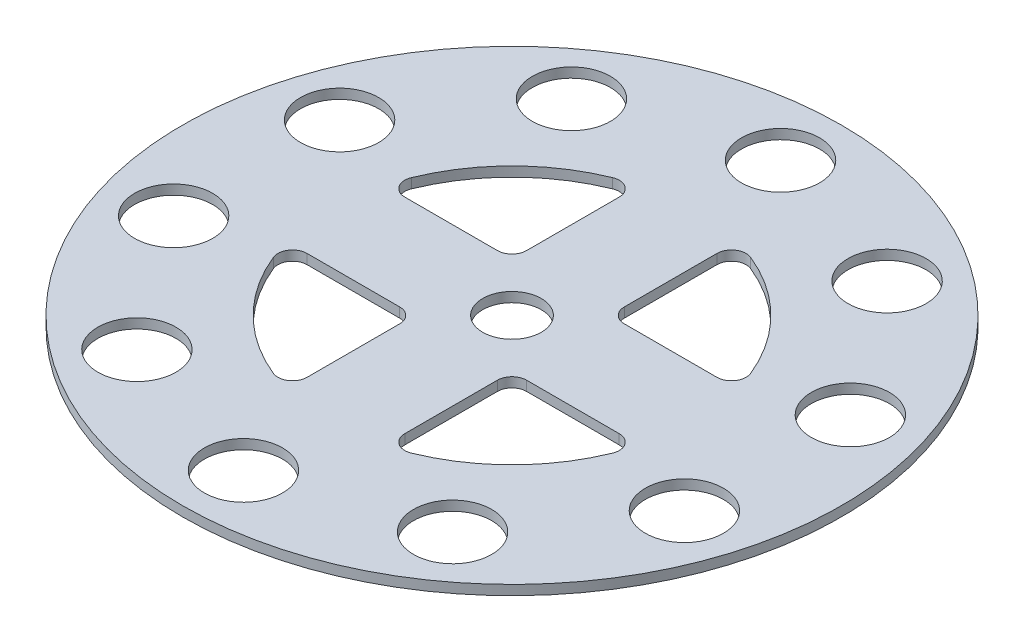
ISO-10303-21;
HEADER;
FILE_DESCRIPTION(('STEP AP214'),'2;1');
FILE_NAME('part.step','',(''),(''),'','','');
FILE_SCHEMA(('AUTOMOTIVE_DESIGN { 1 0 10303 214 1 1 1 1 }'));
ENDSEC;
DATA;
#1=APPLICATION_CONTEXT('core data for automotive mechanical design processes');
#2=APPLICATION_PROTOCOL_DEFINITION('international standard','automotive_design',2000,#1);
#3=PRODUCT_CONTEXT('',#1,'mechanical');
#4=PRODUCT('Part','Part','',(#3));
#5=PRODUCT_RELATED_PRODUCT_CATEGORY('part','',(#4));
#6=PRODUCT_DEFINITION_FORMATION('','',#4);
#7=PRODUCT_DEFINITION_CONTEXT('part definition',#1,'design');
#8=PRODUCT_DEFINITION('design','',#6,#7);
#9=PRODUCT_DEFINITION_SHAPE('','',#8);
#10=(LENGTH_UNIT() NAMED_UNIT(*) SI_UNIT(.MILLI.,.METRE.));
#11=(NAMED_UNIT(*) PLANE_ANGLE_UNIT() SI_UNIT($,.RADIAN.));
#12=(NAMED_UNIT(*) SI_UNIT($,.STERADIAN.) SOLID_ANGLE_UNIT());
#13=UNCERTAINTY_MEASURE_WITH_UNIT(LENGTH_MEASURE(1.E-05),#10,'distance_accuracy_value','');
#14=(GEOMETRIC_REPRESENTATION_CONTEXT(3) GLOBAL_UNCERTAINTY_ASSIGNED_CONTEXT((#13)) GLOBAL_UNIT_ASSIGNED_CONTEXT((#10,
#11,#12)) REPRESENTATION_CONTEXT('',''));
#15=CARTESIAN_POINT('',(0.,0.,0.));
#16=DIRECTION('',(0.,0.,1.));
#17=DIRECTION('',(1.,0.,0.));
#18=AXIS2_PLACEMENT_3D('',#15,#16,#17);
#19=CARTESIAN_POINT('',(0.,2.,0.));
#20=DIRECTION('',(0.,1.,0.));
#21=DIRECTION('',(0.,0.,1.));
#22=AXIS2_PLACEMENT_3D('',#19,#20,#21);
#23=PLANE('',#22);
#24=CARTESIAN_POINT('',(0.,2.,0.));
#25=DIRECTION('',(0.,1.,0.));
#26=DIRECTION('',(0.,0.,1.));
#27=AXIS2_PLACEMENT_3D('',#24,#25,#26);
#28=CIRCLE('',#27,6.);
#29=CARTESIAN_POINT('',(0.,2.,6.));
#30=VERTEX_POINT('',#29);
#31=EDGE_CURVE('E462',#30,#30,#28,.T.);
#32=ORIENTED_EDGE('',*,*,#31,.F.);
#33=EDGE_LOOP('',(#32));
#34=FACE_BOUND('',#33,.T.);
#35=CARTESIAN_POINT('',(-52.3081083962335,2.,-16.995934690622));
#36=DIRECTION('',(0.,1.,0.));
#37=DIRECTION('',(0.951056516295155,0.,0.309016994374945));
#38=AXIS2_PLACEMENT_3D('',#35,#36,#37);
#39=CIRCLE('',#38,8.);
#40=CARTESIAN_POINT('',(-44.6996562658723,2.,-14.5237987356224));
#41=VERTEX_POINT('',#40);
#42=EDGE_CURVE('E457',#41,#41,#39,.T.);
#43=ORIENTED_EDGE('',*,*,#42,.F.);
#44=EDGE_LOOP('',(#43));
#45=FACE_BOUND('',#44,.T.);
#46=CARTESIAN_POINT('',(-52.3081083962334,2.,16.9959346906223));
#47=DIRECTION('',(0.,1.,0.));
#48=DIRECTION('',(0.951056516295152,0.,-0.309016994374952));
#49=AXIS2_PLACEMENT_3D('',#46,#47,#48);
#50=CIRCLE('',#49,8.);
#51=CARTESIAN_POINT('',(-44.6996562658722,2.,14.5237987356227));
#52=VERTEX_POINT('',#51);
#53=EDGE_CURVE('E451',#52,#52,#50,.T.);
#54=ORIENTED_EDGE('',*,*,#53,.F.);
#55=EDGE_LOOP('',(#54));
#56=FACE_BOUND('',#55,.T.);
#57=CARTESIAN_POINT('',(-32.3281888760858,2.,44.4959346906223));
#58=DIRECTION('',(0.,1.,0.));
#59=DIRECTION('',(0.587785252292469,0.,-0.809016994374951));
#60=AXIS2_PLACEMENT_3D('',#57,#58,#59);
#61=CIRCLE('',#60,8.);
#62=CARTESIAN_POINT('',(-27.625906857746,2.,38.0237987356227));
#63=VERTEX_POINT('',#62);
#64=EDGE_CURVE('E445',#63,#63,#61,.T.);
#65=ORIENTED_EDGE('',*,*,#64,.F.);
#66=EDGE_LOOP('',(#65));
#67=FACE_BOUND('',#66,.T.);
#68=CARTESIAN_POINT('',(0.,2.,55.));
#69=DIRECTION('',(0.,1.,0.));
#70=DIRECTION('',(0.,0.,-1.));
#71=AXIS2_PLACEMENT_3D('',#68,#69,#70);
#72=CIRCLE('',#71,8.);
#73=CARTESIAN_POINT('',(0.,2.,47.));
#74=VERTEX_POINT('',#73);
#75=EDGE_CURVE('E439',#74,#74,#72,.T.);
#76=ORIENTED_EDGE('',*,*,#75,.F.);
#77=EDGE_LOOP('',(#76));
#78=FACE_BOUND('',#77,.T.);
#79=CARTESIAN_POINT('',(32.3281888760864,2.,44.4959346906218));
#80=DIRECTION('',(0.,1.,0.));
#81=DIRECTION('',(-0.58778525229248,0.,-0.809016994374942));
#82=AXIS2_PLACEMENT_3D('',#79,#80,#81);
#83=CIRCLE('',#82,8.);
#84=CARTESIAN_POINT('',(27.6259068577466,2.,38.0237987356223));
#85=VERTEX_POINT('',#84);
#86=EDGE_CURVE('E433',#85,#85,#83,.T.);
#87=ORIENTED_EDGE('',*,*,#86,.F.);
#88=EDGE_LOOP('',(#87));
#89=FACE_BOUND('',#88,.T.);
#90=CARTESIAN_POINT('',(52.3081083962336,2.,16.9959346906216));
#91=DIRECTION('',(0.,1.,0.));
#92=DIRECTION('',(-0.951056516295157,0.,-0.309016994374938));
#93=AXIS2_PLACEMENT_3D('',#90,#91,#92);
#94=CIRCLE('',#93,8.);
#95=CARTESIAN_POINT('',(44.6996562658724,2.,14.5237987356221));
#96=VERTEX_POINT('',#95);
#97=EDGE_CURVE('E427',#96,#96,#94,.T.);
#98=ORIENTED_EDGE('',*,*,#97,.F.);
#99=EDGE_LOOP('',(#98));
#100=FACE_BOUND('',#99,.T.);
#101=CARTESIAN_POINT('',(52.3081083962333,2.,-16.9959346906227));
#102=DIRECTION('',(0.,1.,0.));
#103=DIRECTION('',(-0.95105651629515,0.,0.309016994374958));
#104=AXIS2_PLACEMENT_3D('',#101,#102,#103);
#105=CIRCLE('',#104,8.);
#106=CARTESIAN_POINT('',(44.6996562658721,2.,-14.523798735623));
#107=VERTEX_POINT('',#106);
#108=EDGE_CURVE('E421',#107,#107,#105,.T.);
#109=ORIENTED_EDGE('',*,*,#108,.F.);
#110=EDGE_LOOP('',(#109));
#111=FACE_BOUND('',#110,.T.);
#112=CARTESIAN_POINT('',(32.3281888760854,2.,-44.4959346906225));
#113=DIRECTION('',(0.,1.,0.));
#114=DIRECTION('',(-0.587785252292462,0.,0.809016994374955));
#115=AXIS2_PLACEMENT_3D('',#112,#113,#114);
#116=CIRCLE('',#115,8.);
#117=CARTESIAN_POINT('',(27.6259068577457,2.,-38.0237987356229));
#118=VERTEX_POINT('',#117);
#119=EDGE_CURVE('E414',#118,#118,#116,.T.);
#120=ORIENTED_EDGE('',*,*,#119,.F.);
#121=EDGE_LOOP('',(#120));
#122=FACE_BOUND('',#121,.T.);
#123=CARTESIAN_POINT('',(-32.3281888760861,2.,-44.4959346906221));
#124=DIRECTION('',(0.,1.,0.));
#125=DIRECTION('',(0.587785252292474,0.,0.809016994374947));
#126=AXIS2_PLACEMENT_3D('',#123,#124,#125);
#127=CIRCLE('',#126,8.);
#128=CARTESIAN_POINT('',(-27.6259068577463,2.,-38.0237987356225));
#129=VERTEX_POINT('',#128);
#130=EDGE_CURVE('E408',#129,#129,#127,.T.);
#131=ORIENTED_EDGE('',*,*,#130,.F.);
#132=EDGE_LOOP('',(#131));
#133=FACE_BOUND('',#132,.T.);
#134=CARTESIAN_POINT('',(0.,2.,-55.));
#135=DIRECTION('',(0.,1.,0.));
#136=DIRECTION('',(0.,0.,1.));
#137=AXIS2_PLACEMENT_3D('',#134,#135,#136);
#138=CIRCLE('',#137,8.);
#139=CARTESIAN_POINT('',(0.,2.,-47.));
#140=VERTEX_POINT('',#139);
#141=EDGE_CURVE('E402',#140,#140,#138,.T.);
#142=ORIENTED_EDGE('',*,*,#141,.F.);
#143=EDGE_LOOP('',(#142));
#144=FACE_BOUND('',#143,.T.);
#145=CARTESIAN_POINT('',(0.,2.,0.));
#146=DIRECTION('',(0.,1.,0.));
#147=DIRECTION('',(0.,0.,1.));
#148=AXIS2_PLACEMENT_3D('',#145,#146,#147);
#149=CIRCLE('',#148,67.5);
#150=CARTESIAN_POINT('',(0.,2.,67.5));
#151=VERTEX_POINT('',#150);
#152=EDGE_CURVE('E224',#151,#151,#149,.T.);
#153=ORIENTED_EDGE('',*,*,#152,.T.);
#154=EDGE_LOOP('',(#153));
#155=FACE_BOUND('',#154,.T.);
#156=DIRECTION('',(0.,0.,-1.));
#157=VECTOR('',#156,1.);
#158=CARTESIAN_POINT('',(-10.,2.,-36.1420807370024));
#159=LINE('',#158,#157);
#160=CARTESIAN_POINT('',(-10.,2.,-13.));
#161=VERTEX_POINT('',#160);
#162=CARTESIAN_POINT('',(-10.,2.,-31.9570023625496));
#163=VERTEX_POINT('',#162);
#164=EDGE_CURVE('E346',#161,#163,#159,.T.);
#165=ORIENTED_EDGE('',*,*,#164,.F.);
#166=CARTESIAN_POINT('',(-13.,2.,-13.));
#167=DIRECTION('',(0.,1.,0.));
#168=DIRECTION('',(0.,0.,1.));
#169=AXIS2_PLACEMENT_3D('',#166,#167,#168);
#170=CIRCLE('',#169,3.);
#171=CARTESIAN_POINT('',(-13.,2.,-10.));
#172=VERTEX_POINT('',#171);
#173=EDGE_CURVE('E50',#161,#172,#170,.F.);
#174=ORIENTED_EDGE('',*,*,#173,.T.);
#175=DIRECTION('',(1.,0.,0.));
#176=VECTOR('',#175,1.);
#177=CARTESIAN_POINT('',(-36.1420807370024,2.,-10.));
#178=LINE('',#177,#176);
#179=CARTESIAN_POINT('',(-31.9570023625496,2.,-10.));
#180=VERTEX_POINT('',#179);
#181=EDGE_CURVE('E342',#180,#172,#178,.T.);
#182=ORIENTED_EDGE('',*,*,#181,.F.);
#183=CARTESIAN_POINT('',(-31.9570023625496,2.,-13.));
#184=DIRECTION('',(0.,1.,0.));
#185=DIRECTION('',(0.,0.,1.));
#186=AXIS2_PLACEMENT_3D('',#183,#184,#185);
#187=CIRCLE('',#186,3.);
#188=CARTESIAN_POINT('',(-34.7358721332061,2.,-14.1304347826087));
#189=VERTEX_POINT('',#188);
#190=EDGE_CURVE('E11',#180,#189,#187,.F.);
#191=ORIENTED_EDGE('',*,*,#190,.T.);
#192=CARTESIAN_POINT('',(0.,2.,0.));
#193=DIRECTION('',(0.,1.,0.));
#194=DIRECTION('',(0.,0.,1.));
#195=AXIS2_PLACEMENT_3D('',#192,#193,#194);
#196=CIRCLE('',#195,37.5);
#197=CARTESIAN_POINT('',(-14.1304347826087,2.,-34.7358721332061));
#198=VERTEX_POINT('',#197);
#199=EDGE_CURVE('E340',#198,#189,#196,.T.);
#200=ORIENTED_EDGE('',*,*,#199,.F.);
#201=CARTESIAN_POINT('',(-13.,2.,-31.9570023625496));
#202=DIRECTION('',(0.,1.,0.));
#203=DIRECTION('',(0.,0.,1.));
#204=AXIS2_PLACEMENT_3D('',#201,#202,#203);
#205=CIRCLE('',#204,3.);
#206=EDGE_CURVE('E319',#198,#163,#205,.F.);
#207=ORIENTED_EDGE('',*,*,#206,.T.);
#208=EDGE_LOOP('',(#165,#174,#182,#191,#200,#207));
#209=FACE_BOUND('',#208,.T.);
#210=DIRECTION('',(0.,0.,-1.));
#211=VECTOR('',#210,1.);
#212=CARTESIAN_POINT('',(-10.,2.,10.));
#213=LINE('',#212,#211);
#214=CARTESIAN_POINT('',(-10.,2.,31.9570023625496));
#215=VERTEX_POINT('',#214);
#216=CARTESIAN_POINT('',(-10.,2.,13.));
#217=VERTEX_POINT('',#216);
#218=EDGE_CURVE('E369',#215,#217,#213,.T.);
#219=ORIENTED_EDGE('',*,*,#218,.F.);
#220=CARTESIAN_POINT('',(-13.,2.,31.9570023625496));
#221=DIRECTION('',(0.,1.,0.));
#222=DIRECTION('',(0.,0.,1.));
#223=AXIS2_PLACEMENT_3D('',#220,#221,#222);
#224=CIRCLE('',#223,3.);
#225=CARTESIAN_POINT('',(-14.1304347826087,2.,34.7358721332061));
#226=VERTEX_POINT('',#225);
#227=EDGE_CURVE('E299',#215,#226,#224,.F.);
#228=ORIENTED_EDGE('',*,*,#227,.T.);
#229=CARTESIAN_POINT('',(0.,2.,0.));
#230=DIRECTION('',(0.,1.,0.));
#231=DIRECTION('',(0.,0.,1.));
#232=AXIS2_PLACEMENT_3D('',#229,#230,#231);
#233=CIRCLE('',#232,37.5);
#234=CARTESIAN_POINT('',(-34.7358721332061,2.,14.1304347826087));
#235=VERTEX_POINT('',#234);
#236=EDGE_CURVE('E359',#235,#226,#233,.T.);
#237=ORIENTED_EDGE('',*,*,#236,.F.);
#238=CARTESIAN_POINT('',(-31.9570023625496,2.,13.));
#239=DIRECTION('',(0.,1.,0.));
#240=DIRECTION('',(0.,0.,1.));
#241=AXIS2_PLACEMENT_3D('',#238,#239,#240);
#242=CIRCLE('',#241,3.);
#243=CARTESIAN_POINT('',(-31.9570023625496,2.,10.));
#244=VERTEX_POINT('',#243);
#245=EDGE_CURVE('E303',#235,#244,#242,.F.);
#246=ORIENTED_EDGE('',*,*,#245,.T.);
#247=DIRECTION('',(-1.,0.,0.));
#248=VECTOR('',#247,1.);
#249=CARTESIAN_POINT('',(-10.,2.,10.));
#250=LINE('',#249,#248);
#251=CARTESIAN_POINT('',(-13.,2.,10.));
#252=VERTEX_POINT('',#251);
#253=EDGE_CURVE('E334',#252,#244,#250,.T.);
#254=ORIENTED_EDGE('',*,*,#253,.F.);
#255=CARTESIAN_POINT('',(-13.,2.,13.));
#256=DIRECTION('',(0.,1.,0.));
#257=DIRECTION('',(0.,0.,1.));
#258=AXIS2_PLACEMENT_3D('',#255,#256,#257);
#259=CIRCLE('',#258,3.);
#260=EDGE_CURVE('E295',#252,#217,#259,.F.);
#261=ORIENTED_EDGE('',*,*,#260,.T.);
#262=EDGE_LOOP('',(#219,#228,#237,#246,#254,#261));
#263=FACE_BOUND('',#262,.T.);
#264=CARTESIAN_POINT('',(0.,2.,0.));
#265=DIRECTION('',(0.,1.,0.));
#266=DIRECTION('',(0.,0.,1.));
#267=AXIS2_PLACEMENT_3D('',#264,#265,#266);
#268=CIRCLE('',#267,37.5);
#269=CARTESIAN_POINT('',(14.1304347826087,2.,34.7358721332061));
#270=VERTEX_POINT('',#269);
#271=CARTESIAN_POINT('',(34.7358721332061,2.,14.1304347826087));
#272=VERTEX_POINT('',#271);
#273=EDGE_CURVE('E380',#270,#272,#268,.T.);
#274=ORIENTED_EDGE('',*,*,#273,.F.);
#275=CARTESIAN_POINT('',(13.,2.,31.9570023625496));
#276=DIRECTION('',(0.,1.,0.));
#277=DIRECTION('',(0.,0.,1.));
#278=AXIS2_PLACEMENT_3D('',#275,#276,#277);
#279=CIRCLE('',#278,3.);
#280=CARTESIAN_POINT('',(10.,2.,31.9570023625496));
#281=VERTEX_POINT('',#280);
#282=EDGE_CURVE('E209',#270,#281,#279,.F.);
#283=ORIENTED_EDGE('',*,*,#282,.T.);
#284=DIRECTION('',(0.,0.,1.));
#285=VECTOR('',#284,1.);
#286=CARTESIAN_POINT('',(10.,2.,10.));
#287=LINE('',#286,#285);
#288=CARTESIAN_POINT('',(10.,2.,13.));
#289=VERTEX_POINT('',#288);
#290=EDGE_CURVE('E374',#289,#281,#287,.T.);
#291=ORIENTED_EDGE('',*,*,#290,.F.);
#292=CARTESIAN_POINT('',(13.,2.,13.));
#293=DIRECTION('',(0.,1.,0.));
#294=DIRECTION('',(0.,0.,1.));
#295=AXIS2_PLACEMENT_3D('',#292,#293,#294);
#296=CIRCLE('',#295,3.);
#297=CARTESIAN_POINT('',(13.,2.,10.));
#298=VERTEX_POINT('',#297);
#299=EDGE_CURVE('E291',#289,#298,#296,.F.);
#300=ORIENTED_EDGE('',*,*,#299,.T.);
#301=DIRECTION('',(-1.,0.,0.));
#302=VECTOR('',#301,1.);
#303=CARTESIAN_POINT('',(36.1420807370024,2.,10.));
#304=LINE('',#303,#302);
#305=CARTESIAN_POINT('',(31.9570023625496,2.,10.));
#306=VERTEX_POINT('',#305);
#307=EDGE_CURVE('E366',#306,#298,#304,.T.);
#308=ORIENTED_EDGE('',*,*,#307,.F.);
#309=CARTESIAN_POINT('',(31.9570023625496,2.,13.));
#310=DIRECTION('',(0.,1.,0.));
#311=DIRECTION('',(0.,0.,1.));
#312=AXIS2_PLACEMENT_3D('',#309,#310,#311);
#313=CIRCLE('',#312,3.);
#314=EDGE_CURVE('E210',#306,#272,#313,.F.);
#315=ORIENTED_EDGE('',*,*,#314,.T.);
#316=EDGE_LOOP('',(#274,#283,#291,#300,#308,#315));
#317=FACE_BOUND('',#316,.T.);
#318=DIRECTION('',(0.,0.,1.));
#319=VECTOR('',#318,1.);
#320=CARTESIAN_POINT('',(10.,2.,-36.1420807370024));
#321=LINE('',#320,#319);
#322=CARTESIAN_POINT('',(10.,2.,-31.9570023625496));
#323=VERTEX_POINT('',#322);
#324=CARTESIAN_POINT('',(10.,2.,-13.));
#325=VERTEX_POINT('',#324);
#326=EDGE_CURVE('E397',#323,#325,#321,.T.);
#327=ORIENTED_EDGE('',*,*,#326,.F.);
#328=CARTESIAN_POINT('',(13.,2.,-31.9570023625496));
#329=DIRECTION('',(0.,1.,0.));
#330=DIRECTION('',(0.,0.,1.));
#331=AXIS2_PLACEMENT_3D('',#328,#329,#330);
#332=CIRCLE('',#331,3.);
#333=CARTESIAN_POINT('',(14.1304347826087,2.,-34.7358721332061));
#334=VERTEX_POINT('',#333);
#335=EDGE_CURVE('E311',#323,#334,#332,.F.);
#336=ORIENTED_EDGE('',*,*,#335,.T.);
#337=CARTESIAN_POINT('',(0.,2.,0.));
#338=DIRECTION('',(0.,1.,0.));
#339=DIRECTION('',(0.,0.,1.));
#340=AXIS2_PLACEMENT_3D('',#337,#338,#339);
#341=CIRCLE('',#340,37.5);
#342=CARTESIAN_POINT('',(34.7358721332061,2.,-14.1304347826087));
#343=VERTEX_POINT('',#342);
#344=EDGE_CURVE('E387',#343,#334,#341,.T.);
#345=ORIENTED_EDGE('',*,*,#344,.F.);
#346=CARTESIAN_POINT('',(31.9570023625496,2.,-13.));
#347=DIRECTION('',(0.,1.,0.));
#348=DIRECTION('',(0.,0.,1.));
#349=AXIS2_PLACEMENT_3D('',#346,#347,#348);
#350=CIRCLE('',#349,3.);
#351=CARTESIAN_POINT('',(31.9570023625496,2.,-10.));
#352=VERTEX_POINT('',#351);
#353=EDGE_CURVE('E307',#343,#352,#350,.F.);
#354=ORIENTED_EDGE('',*,*,#353,.T.);
#355=DIRECTION('',(1.,0.,0.));
#356=VECTOR('',#355,1.);
#357=CARTESIAN_POINT('',(10.,2.,-10.));
#358=LINE('',#357,#356);
#359=CARTESIAN_POINT('',(13.,2.,-10.));
#360=VERTEX_POINT('',#359);
#361=EDGE_CURVE('E377',#360,#352,#358,.T.);
#362=ORIENTED_EDGE('',*,*,#361,.F.);
#363=CARTESIAN_POINT('',(13.,2.,-13.));
#364=DIRECTION('',(0.,1.,0.));
#365=DIRECTION('',(0.,0.,1.));
#366=AXIS2_PLACEMENT_3D('',#363,#364,#365);
#367=CIRCLE('',#366,3.);
#368=EDGE_CURVE('E315',#360,#325,#367,.F.);
#369=ORIENTED_EDGE('',*,*,#368,.T.);
#370=EDGE_LOOP('',(#327,#336,#345,#354,#362,#369));
#371=FACE_BOUND('',#370,.T.);
#372=ADVANCED_FACE('F35',(#34,#45,#56,#67,#78,#89,#100,#111,#122,#133,#144,#155,#209,#263,#317,
#371),#23,.T.);
#373=CARTESIAN_POINT('',(0.,0.,0.));
#374=DIRECTION('',(0.,1.,0.));
#375=DIRECTION('',(0.,0.,1.));
#376=AXIS2_PLACEMENT_3D('',#373,#374,#375);
#377=PLANE('',#376);
#378=CARTESIAN_POINT('',(0.,0.,0.));
#379=DIRECTION('',(0.,1.,0.));
#380=DIRECTION('',(0.,0.,1.));
#381=AXIS2_PLACEMENT_3D('',#378,#379,#380);
#382=CIRCLE('',#381,6.);
#383=CARTESIAN_POINT('',(0.,0.,6.));
#384=VERTEX_POINT('',#383);
#385=EDGE_CURVE('E418',#384,#384,#382,.T.);
#386=ORIENTED_EDGE('',*,*,#385,.T.);
#387=EDGE_LOOP('',(#386));
#388=FACE_BOUND('',#387,.T.);
#389=CARTESIAN_POINT('',(-52.3081083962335,0.,-16.995934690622));
#390=DIRECTION('',(0.,1.,0.));
#391=DIRECTION('',(0.951056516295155,0.,0.309016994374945));
#392=AXIS2_PLACEMENT_3D('',#389,#390,#391);
#393=CIRCLE('',#392,8.);
#394=CARTESIAN_POINT('',(-44.6996562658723,0.,-14.5237987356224));
#395=VERTEX_POINT('',#394);
#396=EDGE_CURVE('E411',#395,#395,#393,.T.);
#397=ORIENTED_EDGE('',*,*,#396,.T.);
#398=EDGE_LOOP('',(#397));
#399=FACE_BOUND('',#398,.T.);
#400=CARTESIAN_POINT('',(-52.3081083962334,0.,16.9959346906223));
#401=DIRECTION('',(0.,1.,0.));
#402=DIRECTION('',(0.951056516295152,0.,-0.309016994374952));
#403=AXIS2_PLACEMENT_3D('',#400,#401,#402);
#404=CIRCLE('',#403,8.);
#405=CARTESIAN_POINT('',(-44.6996562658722,0.,14.5237987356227));
#406=VERTEX_POINT('',#405);
#407=EDGE_CURVE('E454',#406,#406,#404,.T.);
#408=ORIENTED_EDGE('',*,*,#407,.T.);
#409=EDGE_LOOP('',(#408));
#410=FACE_BOUND('',#409,.T.);
#411=CARTESIAN_POINT('',(-32.3281888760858,0.,44.4959346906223));
#412=DIRECTION('',(0.,1.,0.));
#413=DIRECTION('',(0.587785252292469,0.,-0.809016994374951));
#414=AXIS2_PLACEMENT_3D('',#411,#412,#413);
#415=CIRCLE('',#414,8.);
#416=CARTESIAN_POINT('',(-27.625906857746,0.,38.0237987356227));
#417=VERTEX_POINT('',#416);
#418=EDGE_CURVE('E448',#417,#417,#415,.T.);
#419=ORIENTED_EDGE('',*,*,#418,.T.);
#420=EDGE_LOOP('',(#419));
#421=FACE_BOUND('',#420,.T.);
#422=CARTESIAN_POINT('',(0.,0.,55.));
#423=DIRECTION('',(0.,1.,0.));
#424=DIRECTION('',(0.,0.,-1.));
#425=AXIS2_PLACEMENT_3D('',#422,#423,#424);
#426=CIRCLE('',#425,8.);
#427=CARTESIAN_POINT('',(0.,0.,47.));
#428=VERTEX_POINT('',#427);
#429=EDGE_CURVE('E442',#428,#428,#426,.T.);
#430=ORIENTED_EDGE('',*,*,#429,.T.);
#431=EDGE_LOOP('',(#430));
#432=FACE_BOUND('',#431,.T.);
#433=CARTESIAN_POINT('',(32.3281888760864,0.,44.4959346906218));
#434=DIRECTION('',(0.,1.,0.));
#435=DIRECTION('',(-0.58778525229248,0.,-0.809016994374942));
#436=AXIS2_PLACEMENT_3D('',#433,#434,#435);
#437=CIRCLE('',#436,8.);
#438=CARTESIAN_POINT('',(27.6259068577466,0.,38.0237987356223));
#439=VERTEX_POINT('',#438);
#440=EDGE_CURVE('E436',#439,#439,#437,.T.);
#441=ORIENTED_EDGE('',*,*,#440,.T.);
#442=EDGE_LOOP('',(#441));
#443=FACE_BOUND('',#442,.T.);
#444=CARTESIAN_POINT('',(52.3081083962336,0.,16.9959346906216));
#445=DIRECTION('',(0.,1.,0.));
#446=DIRECTION('',(-0.951056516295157,0.,-0.309016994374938));
#447=AXIS2_PLACEMENT_3D('',#444,#445,#446);
#448=CIRCLE('',#447,8.);
#449=CARTESIAN_POINT('',(44.6996562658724,0.,14.5237987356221));
#450=VERTEX_POINT('',#449);
#451=EDGE_CURVE('E430',#450,#450,#448,.T.);
#452=ORIENTED_EDGE('',*,*,#451,.T.);
#453=EDGE_LOOP('',(#452));
#454=FACE_BOUND('',#453,.T.);
#455=CARTESIAN_POINT('',(52.3081083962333,0.,-16.9959346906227));
#456=DIRECTION('',(0.,1.,0.));
#457=DIRECTION('',(-0.95105651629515,0.,0.309016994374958));
#458=AXIS2_PLACEMENT_3D('',#455,#456,#457);
#459=CIRCLE('',#458,8.);
#460=CARTESIAN_POINT('',(44.6996562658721,0.,-14.523798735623));
#461=VERTEX_POINT('',#460);
#462=EDGE_CURVE('E424',#461,#461,#459,.T.);
#463=ORIENTED_EDGE('',*,*,#462,.T.);
#464=EDGE_LOOP('',(#463));
#465=FACE_BOUND('',#464,.T.);
#466=CARTESIAN_POINT('',(32.3281888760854,0.,-44.4959346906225));
#467=DIRECTION('',(0.,1.,0.));
#468=DIRECTION('',(-0.587785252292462,0.,0.809016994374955));
#469=AXIS2_PLACEMENT_3D('',#466,#467,#468);
#470=CIRCLE('',#469,8.);
#471=CARTESIAN_POINT('',(27.6259068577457,0.,-38.0237987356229));
#472=VERTEX_POINT('',#471);
#473=EDGE_CURVE('E417',#472,#472,#470,.T.);
#474=ORIENTED_EDGE('',*,*,#473,.T.);
#475=EDGE_LOOP('',(#474));
#476=FACE_BOUND('',#475,.T.);
#477=CARTESIAN_POINT('',(-32.3281888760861,0.,-44.4959346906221));
#478=DIRECTION('',(0.,1.,0.));
#479=DIRECTION('',(0.587785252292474,0.,0.809016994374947));
#480=AXIS2_PLACEMENT_3D('',#477,#478,#479);
#481=CIRCLE('',#480,8.);
#482=CARTESIAN_POINT('',(-27.6259068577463,0.,-38.0237987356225));
#483=VERTEX_POINT('',#482);
#484=EDGE_CURVE('E405',#483,#483,#481,.T.);
#485=ORIENTED_EDGE('',*,*,#484,.T.);
#486=EDGE_LOOP('',(#485));
#487=FACE_BOUND('',#486,.T.);
#488=CARTESIAN_POINT('',(0.,0.,-55.));
#489=DIRECTION('',(0.,1.,0.));
#490=DIRECTION('',(0.,0.,1.));
#491=AXIS2_PLACEMENT_3D('',#488,#489,#490);
#492=CIRCLE('',#491,8.);
#493=CARTESIAN_POINT('',(0.,0.,-47.));
#494=VERTEX_POINT('',#493);
#495=EDGE_CURVE('E394',#494,#494,#492,.T.);
#496=ORIENTED_EDGE('',*,*,#495,.T.);
#497=EDGE_LOOP('',(#496));
#498=FACE_BOUND('',#497,.T.);
#499=DIRECTION('',(-1.,0.,0.));
#500=VECTOR('',#499,1.);
#501=CARTESIAN_POINT('',(36.1420807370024,0.,10.));
#502=LINE('',#501,#500);
#503=CARTESIAN_POINT('',(31.9570023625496,0.,10.));
#504=VERTEX_POINT('',#503);
#505=CARTESIAN_POINT('',(13.,0.,10.));
#506=VERTEX_POINT('',#505);
#507=EDGE_CURVE('E220',#504,#506,#502,.T.);
#508=ORIENTED_EDGE('',*,*,#507,.T.);
#509=CARTESIAN_POINT('',(13.,0.,13.));
#510=DIRECTION('',(0.,1.,0.));
#511=DIRECTION('',(0.,0.,1.));
#512=AXIS2_PLACEMENT_3D('',#509,#510,#511);
#513=CIRCLE('',#512,3.);
#514=CARTESIAN_POINT('',(10.,0.,13.));
#515=VERTEX_POINT('',#514);
#516=EDGE_CURVE('E289',#506,#515,#513,.T.);
#517=ORIENTED_EDGE('',*,*,#516,.T.);
#518=DIRECTION('',(0.,0.,1.));
#519=VECTOR('',#518,1.);
#520=CARTESIAN_POINT('',(10.,0.,10.));
#521=LINE('',#520,#519);
#522=CARTESIAN_POINT('',(10.,0.,31.9570023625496));
#523=VERTEX_POINT('',#522);
#524=EDGE_CURVE('E204',#515,#523,#521,.T.);
#525=ORIENTED_EDGE('',*,*,#524,.T.);
#526=CARTESIAN_POINT('',(13.,0.,31.9570023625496));
#527=DIRECTION('',(0.,1.,0.));
#528=DIRECTION('',(0.,0.,1.));
#529=AXIS2_PLACEMENT_3D('',#526,#527,#528);
#530=CIRCLE('',#529,3.);
#531=CARTESIAN_POINT('',(14.1304347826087,0.,34.7358721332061));
#532=VERTEX_POINT('',#531);
#533=EDGE_CURVE('E197',#523,#532,#530,.T.);
#534=ORIENTED_EDGE('',*,*,#533,.T.);
#535=CARTESIAN_POINT('',(0.,0.,0.));
#536=DIRECTION('',(0.,1.,0.));
#537=DIRECTION('',(0.,0.,1.));
#538=AXIS2_PLACEMENT_3D('',#535,#536,#537);
#539=CIRCLE('',#538,37.5);
#540=CARTESIAN_POINT('',(34.7358721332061,0.,14.1304347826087));
#541=VERTEX_POINT('',#540);
#542=EDGE_CURVE('E202',#532,#541,#539,.T.);
#543=ORIENTED_EDGE('',*,*,#542,.T.);
#544=CARTESIAN_POINT('',(31.9570023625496,0.,13.));
#545=DIRECTION('',(0.,1.,0.));
#546=DIRECTION('',(0.,0.,1.));
#547=AXIS2_PLACEMENT_3D('',#544,#545,#546);
#548=CIRCLE('',#547,3.);
#549=EDGE_CURVE('E285',#541,#504,#548,.T.);
#550=ORIENTED_EDGE('',*,*,#549,.T.);
#551=EDGE_LOOP('',(#508,#517,#525,#534,#543,#550));
#552=FACE_BOUND('',#551,.T.);
#553=CARTESIAN_POINT('',(0.,0.,0.));
#554=DIRECTION('',(0.,1.,0.));
#555=DIRECTION('',(0.,0.,1.));
#556=AXIS2_PLACEMENT_3D('',#553,#554,#555);
#557=CIRCLE('',#556,37.5);
#558=CARTESIAN_POINT('',(-14.1304347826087,0.,-34.7358721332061));
#559=VERTEX_POINT('',#558);
#560=CARTESIAN_POINT('',(-34.7358721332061,0.,-14.1304347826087));
#561=VERTEX_POINT('',#560);
#562=EDGE_CURVE('E328',#559,#561,#557,.T.);
#563=ORIENTED_EDGE('',*,*,#562,.T.);
#564=CARTESIAN_POINT('',(-31.9570023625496,0.,-13.));
#565=DIRECTION('',(0.,1.,0.));
#566=DIRECTION('',(0.,0.,1.));
#567=AXIS2_PLACEMENT_3D('',#564,#565,#566);
#568=CIRCLE('',#567,3.);
#569=CARTESIAN_POINT('',(-31.9570023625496,0.,-10.));
#570=VERTEX_POINT('',#569);
#571=EDGE_CURVE('E43',#561,#570,#568,.T.);
#572=ORIENTED_EDGE('',*,*,#571,.T.);
#573=DIRECTION('',(1.,0.,0.));
#574=VECTOR('',#573,1.);
#575=CARTESIAN_POINT('',(-36.1420807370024,0.,-10.));
#576=LINE('',#575,#574);
#577=CARTESIAN_POINT('',(-13.,0.,-10.));
#578=VERTEX_POINT('',#577);
#579=EDGE_CURVE('E326',#570,#578,#576,.T.);
#580=ORIENTED_EDGE('',*,*,#579,.T.);
#581=CARTESIAN_POINT('',(-13.,0.,-13.));
#582=DIRECTION('',(0.,1.,0.));
#583=DIRECTION('',(0.,0.,1.));
#584=AXIS2_PLACEMENT_3D('',#581,#582,#583);
#585=CIRCLE('',#584,3.);
#586=CARTESIAN_POINT('',(-10.,0.,-13.));
#587=VERTEX_POINT('',#586);
#588=EDGE_CURVE('E321',#578,#587,#585,.T.);
#589=ORIENTED_EDGE('',*,*,#588,.T.);
#590=DIRECTION('',(0.,0.,-1.));
#591=VECTOR('',#590,1.);
#592=CARTESIAN_POINT('',(-10.,0.,-36.1420807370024));
#593=LINE('',#592,#591);
#594=CARTESIAN_POINT('',(-10.,0.,-31.9570023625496));
#595=VERTEX_POINT('',#594);
#596=EDGE_CURVE('E333',#587,#595,#593,.T.);
#597=ORIENTED_EDGE('',*,*,#596,.T.);
#598=CARTESIAN_POINT('',(-13.,0.,-31.9570023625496));
#599=DIRECTION('',(0.,1.,0.));
#600=DIRECTION('',(0.,0.,1.));
#601=AXIS2_PLACEMENT_3D('',#598,#599,#600);
#602=CIRCLE('',#601,3.);
#603=EDGE_CURVE('E317',#595,#559,#602,.T.);
#604=ORIENTED_EDGE('',*,*,#603,.T.);
#605=EDGE_LOOP('',(#563,#572,#580,#589,#597,#604));
#606=FACE_BOUND('',#605,.T.);
#607=CARTESIAN_POINT('',(0.,0.,0.));
#608=DIRECTION('',(0.,1.,0.));
#609=DIRECTION('',(0.,0.,1.));
#610=AXIS2_PLACEMENT_3D('',#607,#608,#609);
#611=CIRCLE('',#610,67.5);
#612=CARTESIAN_POINT('',(0.,0.,67.5));
#613=VERTEX_POINT('',#612);
#614=EDGE_CURVE('E229',#613,#613,#611,.T.);
#615=ORIENTED_EDGE('',*,*,#614,.F.);
#616=EDGE_LOOP('',(#615));
#617=FACE_BOUND('',#616,.T.);
#618=DIRECTION('',(-1.,0.,0.));
#619=VECTOR('',#618,1.);
#620=CARTESIAN_POINT('',(-10.,0.,10.));
#621=LINE('',#620,#619);
#622=CARTESIAN_POINT('',(-13.,0.,10.));
#623=VERTEX_POINT('',#622);
#624=CARTESIAN_POINT('',(-31.9570023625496,0.,10.));
#625=VERTEX_POINT('',#624);
#626=EDGE_CURVE('E356',#623,#625,#621,.T.);
#627=ORIENTED_EDGE('',*,*,#626,.T.);
#628=CARTESIAN_POINT('',(-31.9570023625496,0.,13.));
#629=DIRECTION('',(0.,1.,0.));
#630=DIRECTION('',(0.,0.,1.));
#631=AXIS2_PLACEMENT_3D('',#628,#629,#630);
#632=CIRCLE('',#631,3.);
#633=CARTESIAN_POINT('',(-34.7358721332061,0.,14.1304347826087));
#634=VERTEX_POINT('',#633);
#635=EDGE_CURVE('E301',#625,#634,#632,.T.);
#636=ORIENTED_EDGE('',*,*,#635,.T.);
#637=CARTESIAN_POINT('',(0.,0.,0.));
#638=DIRECTION('',(0.,1.,0.));
#639=DIRECTION('',(0.,0.,1.));
#640=AXIS2_PLACEMENT_3D('',#637,#638,#639);
#641=CIRCLE('',#640,37.5);
#642=CARTESIAN_POINT('',(-14.1304347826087,0.,34.7358721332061));
#643=VERTEX_POINT('',#642);
#644=EDGE_CURVE('E363',#634,#643,#641,.T.);
#645=ORIENTED_EDGE('',*,*,#644,.T.);
#646=CARTESIAN_POINT('',(-13.,0.,31.9570023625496));
#647=DIRECTION('',(0.,1.,0.));
#648=DIRECTION('',(0.,0.,1.));
#649=AXIS2_PLACEMENT_3D('',#646,#647,#648);
#650=CIRCLE('',#649,3.);
#651=CARTESIAN_POINT('',(-10.,0.,31.9570023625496));
#652=VERTEX_POINT('',#651);
#653=EDGE_CURVE('E297',#643,#652,#650,.T.);
#654=ORIENTED_EDGE('',*,*,#653,.T.);
#655=DIRECTION('',(0.,0.,-1.));
#656=VECTOR('',#655,1.);
#657=CARTESIAN_POINT('',(-10.,0.,10.));
#658=LINE('',#657,#656);
#659=CARTESIAN_POINT('',(-10.,0.,13.));
#660=VERTEX_POINT('',#659);
#661=EDGE_CURVE('E360',#652,#660,#658,.T.);
#662=ORIENTED_EDGE('',*,*,#661,.T.);
#663=CARTESIAN_POINT('',(-13.,0.,13.));
#664=DIRECTION('',(0.,1.,0.));
#665=DIRECTION('',(0.,0.,1.));
#666=AXIS2_PLACEMENT_3D('',#663,#664,#665);
#667=CIRCLE('',#666,3.);
#668=EDGE_CURVE('E293',#660,#623,#667,.T.);
#669=ORIENTED_EDGE('',*,*,#668,.T.);
#670=EDGE_LOOP('',(#627,#636,#645,#654,#662,#669));
#671=FACE_BOUND('',#670,.T.);
#672=DIRECTION('',(1.,0.,0.));
#673=VECTOR('',#672,1.);
#674=CARTESIAN_POINT('',(10.,0.,-10.));
#675=LINE('',#674,#673);
#676=CARTESIAN_POINT('',(13.,0.,-10.));
#677=VERTEX_POINT('',#676);
#678=CARTESIAN_POINT('',(31.9570023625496,0.,-10.));
#679=VERTEX_POINT('',#678);
#680=EDGE_CURVE('E384',#677,#679,#675,.T.);
#681=ORIENTED_EDGE('',*,*,#680,.T.);
#682=CARTESIAN_POINT('',(31.9570023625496,0.,-13.));
#683=DIRECTION('',(0.,1.,0.));
#684=DIRECTION('',(0.,0.,1.));
#685=AXIS2_PLACEMENT_3D('',#682,#683,#684);
#686=CIRCLE('',#685,3.);
#687=CARTESIAN_POINT('',(34.7358721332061,0.,-14.1304347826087));
#688=VERTEX_POINT('',#687);
#689=EDGE_CURVE('E305',#679,#688,#686,.T.);
#690=ORIENTED_EDGE('',*,*,#689,.T.);
#691=CARTESIAN_POINT('',(0.,0.,0.));
#692=DIRECTION('',(0.,1.,0.));
#693=DIRECTION('',(0.,0.,1.));
#694=AXIS2_PLACEMENT_3D('',#691,#692,#693);
#695=CIRCLE('',#694,37.5);
#696=CARTESIAN_POINT('',(14.1304347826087,0.,-34.7358721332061));
#697=VERTEX_POINT('',#696);
#698=EDGE_CURVE('E391',#688,#697,#695,.T.);
#699=ORIENTED_EDGE('',*,*,#698,.T.);
#700=CARTESIAN_POINT('',(13.,0.,-31.9570023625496));
#701=DIRECTION('',(0.,1.,0.));
#702=DIRECTION('',(0.,0.,1.));
#703=AXIS2_PLACEMENT_3D('',#700,#701,#702);
#704=CIRCLE('',#703,3.);
#705=CARTESIAN_POINT('',(10.,0.,-31.9570023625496));
#706=VERTEX_POINT('',#705);
#707=EDGE_CURVE('E309',#697,#706,#704,.T.);
#708=ORIENTED_EDGE('',*,*,#707,.T.);
#709=DIRECTION('',(0.,0.,1.));
#710=VECTOR('',#709,1.);
#711=CARTESIAN_POINT('',(10.,0.,-36.1420807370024));
#712=LINE('',#711,#710);
#713=CARTESIAN_POINT('',(10.,0.,-13.));
#714=VERTEX_POINT('',#713);
#715=EDGE_CURVE('E388',#706,#714,#712,.T.);
#716=ORIENTED_EDGE('',*,*,#715,.T.);
#717=CARTESIAN_POINT('',(13.,0.,-13.));
#718=DIRECTION('',(0.,1.,0.));
#719=DIRECTION('',(0.,0.,1.));
#720=AXIS2_PLACEMENT_3D('',#717,#718,#719);
#721=CIRCLE('',#720,3.);
#722=EDGE_CURVE('E313',#714,#677,#721,.T.);
#723=ORIENTED_EDGE('',*,*,#722,.T.);
#724=EDGE_LOOP('',(#681,#690,#699,#708,#716,#723));
#725=FACE_BOUND('',#724,.T.);
#726=ADVANCED_FACE('F200',(#388,#399,#410,#421,#432,#443,#454,#465,#476,#487,#498,#552,#606,
#617,#671,#725),#377,.F.);
#727=CARTESIAN_POINT('',(0.,2.,0.));
#728=DIRECTION('',(0.,-1.,0.));
#729=DIRECTION('',(0.,0.,-1.));
#730=AXIS2_PLACEMENT_3D('',#727,#728,#729);
#731=CYLINDRICAL_SURFACE('',#730,67.5);
#732=ORIENTED_EDGE('',*,*,#152,.F.);
#733=EDGE_LOOP('',(#732));
#734=FACE_BOUND('',#733,.T.);
#735=ORIENTED_EDGE('',*,*,#614,.T.);
#736=EDGE_LOOP('',(#735));
#737=FACE_BOUND('',#736,.T.);
#738=ADVANCED_FACE('F503',(#734,#737),#731,.T.);
#739=CARTESIAN_POINT('',(-36.1420807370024,2.,-10.));
#740=DIRECTION('',(0.,0.,-1.));
#741=DIRECTION('',(-1.,0.,0.));
#742=AXIS2_PLACEMENT_3D('',#739,#740,#741);
#743=PLANE('',#742);
#744=ORIENTED_EDGE('',*,*,#181,.T.);
#745=DIRECTION('',(0.,-1.,0.));
#746=VECTOR('',#745,1.);
#747=CARTESIAN_POINT('',(-13.,0.,-10.));
#748=LINE('',#747,#746);
#749=EDGE_CURVE('E282',#172,#578,#748,.T.);
#750=ORIENTED_EDGE('',*,*,#749,.T.);
#751=ORIENTED_EDGE('',*,*,#579,.F.);
#752=DIRECTION('',(0.,1.,0.));
#753=VECTOR('',#752,1.);
#754=CARTESIAN_POINT('',(-31.9570023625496,2.,-10.));
#755=LINE('',#754,#753);
#756=EDGE_CURVE('E57',#570,#180,#755,.T.);
#757=ORIENTED_EDGE('',*,*,#756,.T.);
#758=EDGE_LOOP('',(#744,#750,#751,#757));
#759=FACE_BOUND('',#758,.T.);
#760=ADVANCED_FACE('F331',(#759),#743,.T.);
#761=CARTESIAN_POINT('',(-10.,2.,-36.1420807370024));
#762=DIRECTION('',(-1.,0.,0.));
#763=DIRECTION('',(0.,0.,1.));
#764=AXIS2_PLACEMENT_3D('',#761,#762,#763);
#765=PLANE('',#764);
#766=ORIENTED_EDGE('',*,*,#164,.T.);
#767=DIRECTION('',(0.,1.,0.));
#768=VECTOR('',#767,1.);
#769=CARTESIAN_POINT('',(-10.,0.,-31.9570023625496));
#770=LINE('',#769,#768);
#771=EDGE_CURVE('E273',#163,#595,#770,.F.);
#772=ORIENTED_EDGE('',*,*,#771,.T.);
#773=ORIENTED_EDGE('',*,*,#596,.F.);
#774=DIRECTION('',(0.,-1.,0.));
#775=VECTOR('',#774,1.);
#776=CARTESIAN_POINT('',(-10.,2.,-13.));
#777=LINE('',#776,#775);
#778=EDGE_CURVE('E271',#587,#161,#777,.F.);
#779=ORIENTED_EDGE('',*,*,#778,.T.);
#780=EDGE_LOOP('',(#766,#772,#773,#779));
#781=FACE_BOUND('',#780,.T.);
#782=ADVANCED_FACE('F568',(#781),#765,.T.);
#783=CARTESIAN_POINT('',(0.,2.,0.));
#784=DIRECTION('',(0.,-1.,0.));
#785=DIRECTION('',(0.,0.,-1.));
#786=AXIS2_PLACEMENT_3D('',#783,#784,#785);
#787=CYLINDRICAL_SURFACE('',#786,37.5);
#788=ORIENTED_EDGE('',*,*,#562,.F.);
#789=DIRECTION('',(0.,-1.,0.));
#790=VECTOR('',#789,1.);
#791=CARTESIAN_POINT('',(-14.1304347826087,2.,-34.7358721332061));
#792=LINE('',#791,#790);
#793=EDGE_CURVE('E279',#559,#198,#792,.F.);
#794=ORIENTED_EDGE('',*,*,#793,.T.);
#795=ORIENTED_EDGE('',*,*,#199,.T.);
#796=DIRECTION('',(0.,-1.,0.));
#797=VECTOR('',#796,1.);
#798=CARTESIAN_POINT('',(-34.7358721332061,2.,-14.1304347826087));
#799=LINE('',#798,#797);
#800=EDGE_CURVE('E276',#189,#561,#799,.T.);
#801=ORIENTED_EDGE('',*,*,#800,.T.);
#802=EDGE_LOOP('',(#788,#794,#795,#801));
#803=FACE_BOUND('',#802,.T.);
#804=ADVANCED_FACE('F344',(#803),#787,.F.);
#805=CARTESIAN_POINT('',(0.,2.,0.));
#806=DIRECTION('',(0.,-1.,0.));
#807=DIRECTION('',(0.,0.,-1.));
#808=AXIS2_PLACEMENT_3D('',#805,#806,#807);
#809=CYLINDRICAL_SURFACE('',#808,37.5);
#810=ORIENTED_EDGE('',*,*,#236,.T.);
#811=DIRECTION('',(0.,-1.,0.));
#812=VECTOR('',#811,1.);
#813=CARTESIAN_POINT('',(-14.1304347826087,2.,34.7358721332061));
#814=LINE('',#813,#812);
#815=EDGE_CURVE('E253',#226,#643,#814,.T.);
#816=ORIENTED_EDGE('',*,*,#815,.T.);
#817=ORIENTED_EDGE('',*,*,#644,.F.);
#818=DIRECTION('',(0.,-1.,0.));
#819=VECTOR('',#818,1.);
#820=CARTESIAN_POINT('',(-34.7358721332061,2.,14.1304347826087));
#821=LINE('',#820,#819);
#822=EDGE_CURVE('E251',#634,#235,#821,.F.);
#823=ORIENTED_EDGE('',*,*,#822,.T.);
#824=EDGE_LOOP('',(#810,#816,#817,#823));
#825=FACE_BOUND('',#824,.T.);
#826=ADVANCED_FACE('F576',(#825),#809,.F.);
#827=CARTESIAN_POINT('',(-10.,2.,10.));
#828=DIRECTION('',(-1.,0.,0.));
#829=DIRECTION('',(0.,0.,1.));
#830=AXIS2_PLACEMENT_3D('',#827,#828,#829);
#831=PLANE('',#830);
#832=ORIENTED_EDGE('',*,*,#218,.T.);
#833=DIRECTION('',(0.,-1.,0.));
#834=VECTOR('',#833,1.);
#835=CARTESIAN_POINT('',(-10.,0.,13.));
#836=LINE('',#835,#834);
#837=EDGE_CURVE('E243',#217,#660,#836,.T.);
#838=ORIENTED_EDGE('',*,*,#837,.T.);
#839=ORIENTED_EDGE('',*,*,#661,.F.);
#840=DIRECTION('',(0.,1.,0.));
#841=VECTOR('',#840,1.);
#842=CARTESIAN_POINT('',(-10.,2.,31.9570023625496));
#843=LINE('',#842,#841);
#844=EDGE_CURVE('E241',#652,#215,#843,.T.);
#845=ORIENTED_EDGE('',*,*,#844,.T.);
#846=EDGE_LOOP('',(#832,#838,#839,#845));
#847=FACE_BOUND('',#846,.T.);
#848=ADVANCED_FACE('F615',(#847),#831,.T.);
#849=CARTESIAN_POINT('',(-10.,2.,10.));
#850=DIRECTION('',(0.,0.,1.));
#851=DIRECTION('',(1.,0.,0.));
#852=AXIS2_PLACEMENT_3D('',#849,#850,#851);
#853=PLANE('',#852);
#854=ORIENTED_EDGE('',*,*,#626,.F.);
#855=DIRECTION('',(0.,-1.,0.));
#856=VECTOR('',#855,1.);
#857=CARTESIAN_POINT('',(-13.,2.,10.));
#858=LINE('',#857,#856);
#859=EDGE_CURVE('E249',#623,#252,#858,.F.);
#860=ORIENTED_EDGE('',*,*,#859,.T.);
#861=ORIENTED_EDGE('',*,*,#253,.T.);
#862=DIRECTION('',(0.,1.,0.));
#863=VECTOR('',#862,1.);
#864=CARTESIAN_POINT('',(-31.9570023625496,0.,10.));
#865=LINE('',#864,#863);
#866=EDGE_CURVE('E246',#244,#625,#865,.F.);
#867=ORIENTED_EDGE('',*,*,#866,.T.);
#868=EDGE_LOOP('',(#854,#860,#861,#867));
#869=FACE_BOUND('',#868,.T.);
#870=ADVANCED_FACE('F611',(#869),#853,.T.);
#871=CARTESIAN_POINT('',(10.,2.,10.));
#872=DIRECTION('',(1.,0.,0.));
#873=DIRECTION('',(0.,0.,-1.));
#874=AXIS2_PLACEMENT_3D('',#871,#872,#873);
#875=PLANE('',#874);
#876=ORIENTED_EDGE('',*,*,#290,.T.);
#877=DIRECTION('',(0.,1.,0.));
#878=VECTOR('',#877,1.);
#879=CARTESIAN_POINT('',(10.,0.,31.9570023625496));
#880=LINE('',#879,#878);
#881=EDGE_CURVE('E239',#281,#523,#880,.F.);
#882=ORIENTED_EDGE('',*,*,#881,.T.);
#883=ORIENTED_EDGE('',*,*,#524,.F.);
#884=DIRECTION('',(0.,-1.,0.));
#885=VECTOR('',#884,1.);
#886=CARTESIAN_POINT('',(10.,2.,13.));
#887=LINE('',#886,#885);
#888=EDGE_CURVE('E237',#515,#289,#887,.F.);
#889=ORIENTED_EDGE('',*,*,#888,.T.);
#890=EDGE_LOOP('',(#876,#882,#883,#889));
#891=FACE_BOUND('',#890,.T.);
#892=ADVANCED_FACE('F623',(#891),#875,.T.);
#893=CARTESIAN_POINT('',(0.,2.,0.));
#894=DIRECTION('',(0.,-1.,0.));
#895=DIRECTION('',(0.,0.,-1.));
#896=AXIS2_PLACEMENT_3D('',#893,#894,#895);
#897=CYLINDRICAL_SURFACE('',#896,37.5);
#898=ORIENTED_EDGE('',*,*,#273,.T.);
#899=DIRECTION('',(0.,-1.,0.));
#900=VECTOR('',#899,1.);
#901=CARTESIAN_POINT('',(34.7358721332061,2.,14.1304347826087));
#902=LINE('',#901,#900);
#903=EDGE_CURVE('E219',#272,#541,#902,.T.);
#904=ORIENTED_EDGE('',*,*,#903,.T.);
#905=ORIENTED_EDGE('',*,*,#542,.F.);
#906=DIRECTION('',(0.,-1.,0.));
#907=VECTOR('',#906,1.);
#908=CARTESIAN_POINT('',(14.1304347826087,2.,34.7358721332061));
#909=LINE('',#908,#907);
#910=EDGE_CURVE('E216',#532,#270,#909,.F.);
#911=ORIENTED_EDGE('',*,*,#910,.T.);
#912=EDGE_LOOP('',(#898,#904,#905,#911));
#913=FACE_BOUND('',#912,.T.);
#914=ADVANCED_FACE('F215',(#913),#897,.F.);
#915=CARTESIAN_POINT('',(36.1420807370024,2.,10.));
#916=DIRECTION('',(0.,0.,1.));
#917=DIRECTION('',(1.,0.,0.));
#918=AXIS2_PLACEMENT_3D('',#915,#916,#917);
#919=PLANE('',#918);
#920=ORIENTED_EDGE('',*,*,#507,.F.);
#921=DIRECTION('',(0.,1.,0.));
#922=VECTOR('',#921,1.);
#923=CARTESIAN_POINT('',(31.9570023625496,2.,10.));
#924=LINE('',#923,#922);
#925=EDGE_CURVE('E235',#504,#306,#924,.T.);
#926=ORIENTED_EDGE('',*,*,#925,.T.);
#927=ORIENTED_EDGE('',*,*,#307,.T.);
#928=DIRECTION('',(0.,-1.,0.));
#929=VECTOR('',#928,1.);
#930=CARTESIAN_POINT('',(13.,0.,10.));
#931=LINE('',#930,#929);
#932=EDGE_CURVE('E226',#298,#506,#931,.T.);
#933=ORIENTED_EDGE('',*,*,#932,.T.);
#934=EDGE_LOOP('',(#920,#926,#927,#933));
#935=FACE_BOUND('',#934,.T.);
#936=ADVANCED_FACE('F631',(#935),#919,.T.);
#937=CARTESIAN_POINT('',(0.,2.,0.));
#938=DIRECTION('',(0.,-1.,0.));
#939=DIRECTION('',(0.,0.,-1.));
#940=AXIS2_PLACEMENT_3D('',#937,#938,#939);
#941=CYLINDRICAL_SURFACE('',#940,37.5);
#942=ORIENTED_EDGE('',*,*,#698,.F.);
#943=DIRECTION('',(0.,-1.,0.));
#944=VECTOR('',#943,1.);
#945=CARTESIAN_POINT('',(34.7358721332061,2.,-14.1304347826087));
#946=LINE('',#945,#944);
#947=EDGE_CURVE('E264',#688,#343,#946,.F.);
#948=ORIENTED_EDGE('',*,*,#947,.T.);
#949=ORIENTED_EDGE('',*,*,#344,.T.);
#950=DIRECTION('',(0.,-1.,0.));
#951=VECTOR('',#950,1.);
#952=CARTESIAN_POINT('',(14.1304347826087,2.,-34.7358721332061));
#953=LINE('',#952,#951);
#954=EDGE_CURVE('E261',#334,#697,#953,.T.);
#955=ORIENTED_EDGE('',*,*,#954,.T.);
#956=EDGE_LOOP('',(#942,#948,#949,#955));
#957=FACE_BOUND('',#956,.T.);
#958=ADVANCED_FACE('F537',(#957),#941,.F.);
#959=CARTESIAN_POINT('',(10.,2.,-36.1420807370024));
#960=DIRECTION('',(1.,0.,0.));
#961=DIRECTION('',(0.,0.,-1.));
#962=AXIS2_PLACEMENT_3D('',#959,#960,#961);
#963=PLANE('',#962);
#964=ORIENTED_EDGE('',*,*,#715,.F.);
#965=DIRECTION('',(0.,1.,0.));
#966=VECTOR('',#965,1.);
#967=CARTESIAN_POINT('',(10.,2.,-31.9570023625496));
#968=LINE('',#967,#966);
#969=EDGE_CURVE('E269',#706,#323,#968,.T.);
#970=ORIENTED_EDGE('',*,*,#969,.T.);
#971=ORIENTED_EDGE('',*,*,#326,.T.);
#972=DIRECTION('',(0.,-1.,0.));
#973=VECTOR('',#972,1.);
#974=CARTESIAN_POINT('',(10.,0.,-13.));
#975=LINE('',#974,#973);
#976=EDGE_CURVE('E266',#325,#714,#975,.T.);
#977=ORIENTED_EDGE('',*,*,#976,.T.);
#978=EDGE_LOOP('',(#964,#970,#971,#977));
#979=FACE_BOUND('',#978,.T.);
#980=ADVANCED_FACE('F529',(#979),#963,.T.);
#981=CARTESIAN_POINT('',(10.,2.,-10.));
#982=DIRECTION('',(0.,0.,-1.));
#983=DIRECTION('',(-1.,0.,0.));
#984=AXIS2_PLACEMENT_3D('',#981,#982,#983);
#985=PLANE('',#984);
#986=ORIENTED_EDGE('',*,*,#361,.T.);
#987=DIRECTION('',(0.,1.,0.));
#988=VECTOR('',#987,1.);
#989=CARTESIAN_POINT('',(31.9570023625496,0.,-10.));
#990=LINE('',#989,#988);
#991=EDGE_CURVE('E258',#352,#679,#990,.F.);
#992=ORIENTED_EDGE('',*,*,#991,.T.);
#993=ORIENTED_EDGE('',*,*,#680,.F.);
#994=DIRECTION('',(0.,-1.,0.));
#995=VECTOR('',#994,1.);
#996=CARTESIAN_POINT('',(13.,2.,-10.));
#997=LINE('',#996,#995);
#998=EDGE_CURVE('E256',#677,#360,#997,.F.);
#999=ORIENTED_EDGE('',*,*,#998,.T.);
#1000=EDGE_LOOP('',(#986,#992,#993,#999));
#1001=FACE_BOUND('',#1000,.T.);
#1002=ADVANCED_FACE('F517',(#1001),#985,.T.);
#1003=CARTESIAN_POINT('',(0.,0.,-55.));
#1004=DIRECTION('',(0.,1.,0.));
#1005=DIRECTION('',(0.,0.,1.));
#1006=AXIS2_PLACEMENT_3D('',#1003,#1004,#1005);
#1007=CYLINDRICAL_SURFACE('',#1006,8.);
#1008=ORIENTED_EDGE('',*,*,#495,.F.);
#1009=EDGE_LOOP('',(#1008));
#1010=FACE_BOUND('',#1009,.T.);
#1011=ORIENTED_EDGE('',*,*,#141,.T.);
#1012=EDGE_LOOP('',(#1011));
#1013=FACE_BOUND('',#1012,.T.);
#1014=ADVANCED_FACE('F641',(#1010,#1013),#1007,.F.);
#1015=CARTESIAN_POINT('',(-32.3281888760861,0.,-44.4959346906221));
#1016=DIRECTION('',(0.,1.,0.));
#1017=DIRECTION('',(0.,0.,1.));
#1018=AXIS2_PLACEMENT_3D('',#1015,#1016,#1017);
#1019=CYLINDRICAL_SURFACE('',#1018,8.);
#1020=ORIENTED_EDGE('',*,*,#484,.F.);
#1021=EDGE_LOOP('',(#1020));
#1022=FACE_BOUND('',#1021,.T.);
#1023=ORIENTED_EDGE('',*,*,#130,.T.);
#1024=EDGE_LOOP('',(#1023));
#1025=FACE_BOUND('',#1024,.T.);
#1026=ADVANCED_FACE('F644',(#1022,#1025),#1019,.F.);
#1027=CARTESIAN_POINT('',(32.3281888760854,0.,-44.4959346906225));
#1028=DIRECTION('',(0.,1.,0.));
#1029=DIRECTION('',(0.,0.,1.));
#1030=AXIS2_PLACEMENT_3D('',#1027,#1028,#1029);
#1031=CYLINDRICAL_SURFACE('',#1030,8.);
#1032=ORIENTED_EDGE('',*,*,#473,.F.);
#1033=EDGE_LOOP('',(#1032));
#1034=FACE_BOUND('',#1033,.T.);
#1035=ORIENTED_EDGE('',*,*,#119,.T.);
#1036=EDGE_LOOP('',(#1035));
#1037=FACE_BOUND('',#1036,.T.);
#1038=ADVANCED_FACE('F648',(#1034,#1037),#1031,.F.);
#1039=CARTESIAN_POINT('',(52.3081083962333,0.,-16.9959346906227));
#1040=DIRECTION('',(0.,1.,0.));
#1041=DIRECTION('',(0.,0.,1.));
#1042=AXIS2_PLACEMENT_3D('',#1039,#1040,#1041);
#1043=CYLINDRICAL_SURFACE('',#1042,8.);
#1044=ORIENTED_EDGE('',*,*,#462,.F.);
#1045=EDGE_LOOP('',(#1044));
#1046=FACE_BOUND('',#1045,.T.);
#1047=ORIENTED_EDGE('',*,*,#108,.T.);
#1048=EDGE_LOOP('',(#1047));
#1049=FACE_BOUND('',#1048,.T.);
#1050=ADVANCED_FACE('F652',(#1046,#1049),#1043,.F.);
#1051=CARTESIAN_POINT('',(52.3081083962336,0.,16.9959346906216));
#1052=DIRECTION('',(0.,1.,0.));
#1053=DIRECTION('',(0.,0.,1.));
#1054=AXIS2_PLACEMENT_3D('',#1051,#1052,#1053);
#1055=CYLINDRICAL_SURFACE('',#1054,8.);
#1056=ORIENTED_EDGE('',*,*,#451,.F.);
#1057=EDGE_LOOP('',(#1056));
#1058=FACE_BOUND('',#1057,.T.);
#1059=ORIENTED_EDGE('',*,*,#97,.T.);
#1060=EDGE_LOOP('',(#1059));
#1061=FACE_BOUND('',#1060,.T.);
#1062=ADVANCED_FACE('F656',(#1058,#1061),#1055,.F.);
#1063=CARTESIAN_POINT('',(32.3281888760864,0.,44.4959346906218));
#1064=DIRECTION('',(0.,1.,0.));
#1065=DIRECTION('',(0.,0.,1.));
#1066=AXIS2_PLACEMENT_3D('',#1063,#1064,#1065);
#1067=CYLINDRICAL_SURFACE('',#1066,8.);
#1068=ORIENTED_EDGE('',*,*,#440,.F.);
#1069=EDGE_LOOP('',(#1068));
#1070=FACE_BOUND('',#1069,.T.);
#1071=ORIENTED_EDGE('',*,*,#86,.T.);
#1072=EDGE_LOOP('',(#1071));
#1073=FACE_BOUND('',#1072,.T.);
#1074=ADVANCED_FACE('F660',(#1070,#1073),#1067,.F.);
#1075=CARTESIAN_POINT('',(0.,0.,55.));
#1076=DIRECTION('',(0.,1.,0.));
#1077=DIRECTION('',(0.,0.,1.));
#1078=AXIS2_PLACEMENT_3D('',#1075,#1076,#1077);
#1079=CYLINDRICAL_SURFACE('',#1078,8.);
#1080=ORIENTED_EDGE('',*,*,#429,.F.);
#1081=EDGE_LOOP('',(#1080));
#1082=FACE_BOUND('',#1081,.T.);
#1083=ORIENTED_EDGE('',*,*,#75,.T.);
#1084=EDGE_LOOP('',(#1083));
#1085=FACE_BOUND('',#1084,.T.);
#1086=ADVANCED_FACE('F664',(#1082,#1085),#1079,.F.);
#1087=CARTESIAN_POINT('',(-32.3281888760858,0.,44.4959346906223));
#1088=DIRECTION('',(0.,1.,0.));
#1089=DIRECTION('',(0.,0.,1.));
#1090=AXIS2_PLACEMENT_3D('',#1087,#1088,#1089);
#1091=CYLINDRICAL_SURFACE('',#1090,8.);
#1092=ORIENTED_EDGE('',*,*,#418,.F.);
#1093=EDGE_LOOP('',(#1092));
#1094=FACE_BOUND('',#1093,.T.);
#1095=ORIENTED_EDGE('',*,*,#64,.T.);
#1096=EDGE_LOOP('',(#1095));
#1097=FACE_BOUND('',#1096,.T.);
#1098=ADVANCED_FACE('F668',(#1094,#1097),#1091,.F.);
#1099=CARTESIAN_POINT('',(-52.3081083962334,0.,16.9959346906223));
#1100=DIRECTION('',(0.,1.,0.));
#1101=DIRECTION('',(0.,0.,1.));
#1102=AXIS2_PLACEMENT_3D('',#1099,#1100,#1101);
#1103=CYLINDRICAL_SURFACE('',#1102,8.);
#1104=ORIENTED_EDGE('',*,*,#407,.F.);
#1105=EDGE_LOOP('',(#1104));
#1106=FACE_BOUND('',#1105,.T.);
#1107=ORIENTED_EDGE('',*,*,#53,.T.);
#1108=EDGE_LOOP('',(#1107));
#1109=FACE_BOUND('',#1108,.T.);
#1110=ADVANCED_FACE('F672',(#1106,#1109),#1103,.F.);
#1111=CARTESIAN_POINT('',(-52.3081083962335,0.,-16.995934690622));
#1112=DIRECTION('',(0.,1.,0.));
#1113=DIRECTION('',(0.,0.,1.));
#1114=AXIS2_PLACEMENT_3D('',#1111,#1112,#1113);
#1115=CYLINDRICAL_SURFACE('',#1114,8.);
#1116=ORIENTED_EDGE('',*,*,#396,.F.);
#1117=EDGE_LOOP('',(#1116));
#1118=FACE_BOUND('',#1117,.T.);
#1119=ORIENTED_EDGE('',*,*,#42,.T.);
#1120=EDGE_LOOP('',(#1119));
#1121=FACE_BOUND('',#1120,.T.);
#1122=ADVANCED_FACE('F474',(#1118,#1121),#1115,.F.);
#1123=CARTESIAN_POINT('',(0.,0.,0.));
#1124=DIRECTION('',(0.,1.,0.));
#1125=DIRECTION('',(0.,0.,1.));
#1126=AXIS2_PLACEMENT_3D('',#1123,#1124,#1125);
#1127=CYLINDRICAL_SURFACE('',#1126,6.);
#1128=ORIENTED_EDGE('',*,*,#385,.F.);
#1129=EDGE_LOOP('',(#1128));
#1130=FACE_BOUND('',#1129,.T.);
#1131=ORIENTED_EDGE('',*,*,#31,.T.);
#1132=EDGE_LOOP('',(#1131));
#1133=FACE_BOUND('',#1132,.T.);
#1134=ADVANCED_FACE('F470',(#1130,#1133),#1127,.F.);
#1135=CARTESIAN_POINT('',(31.9570023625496,2.,13.));
#1136=DIRECTION('',(0.,-1.,0.));
#1137=DIRECTION('',(0.,0.,-1.));
#1138=AXIS2_PLACEMENT_3D('',#1135,#1136,#1137);
#1139=CYLINDRICAL_SURFACE('',#1138,3.);
#1140=ORIENTED_EDGE('',*,*,#314,.F.);
#1141=ORIENTED_EDGE('',*,*,#925,.F.);
#1142=ORIENTED_EDGE('',*,*,#549,.F.);
#1143=ORIENTED_EDGE('',*,*,#903,.F.);
#1144=EDGE_LOOP('',(#1140,#1141,#1142,#1143));
#1145=FACE_BOUND('',#1144,.T.);
#1146=ADVANCED_FACE('F473',(#1145),#1139,.F.);
#1147=CARTESIAN_POINT('',(13.,2.,31.9570023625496));
#1148=DIRECTION('',(0.,-1.,0.));
#1149=DIRECTION('',(0.,0.,-1.));
#1150=AXIS2_PLACEMENT_3D('',#1147,#1148,#1149);
#1151=CYLINDRICAL_SURFACE('',#1150,3.);
#1152=ORIENTED_EDGE('',*,*,#282,.F.);
#1153=ORIENTED_EDGE('',*,*,#910,.F.);
#1154=ORIENTED_EDGE('',*,*,#533,.F.);
#1155=ORIENTED_EDGE('',*,*,#881,.F.);
#1156=EDGE_LOOP('',(#1152,#1153,#1154,#1155));
#1157=FACE_BOUND('',#1156,.T.);
#1158=ADVANCED_FACE('F223',(#1157),#1151,.F.);
#1159=CARTESIAN_POINT('',(13.,2.,13.));
#1160=DIRECTION('',(0.,1.,0.));
#1161=DIRECTION('',(0.,0.,1.));
#1162=AXIS2_PLACEMENT_3D('',#1159,#1160,#1161);
#1163=CYLINDRICAL_SURFACE('',#1162,3.);
#1164=ORIENTED_EDGE('',*,*,#299,.F.);
#1165=ORIENTED_EDGE('',*,*,#888,.F.);
#1166=ORIENTED_EDGE('',*,*,#516,.F.);
#1167=ORIENTED_EDGE('',*,*,#932,.F.);
#1168=EDGE_LOOP('',(#1164,#1165,#1166,#1167));
#1169=FACE_BOUND('',#1168,.T.);
#1170=ADVANCED_FACE('F586',(#1169),#1163,.F.);
#1171=CARTESIAN_POINT('',(-13.,2.,13.));
#1172=DIRECTION('',(0.,1.,0.));
#1173=DIRECTION('',(0.,0.,1.));
#1174=AXIS2_PLACEMENT_3D('',#1171,#1172,#1173);
#1175=CYLINDRICAL_SURFACE('',#1174,3.);
#1176=ORIENTED_EDGE('',*,*,#260,.F.);
#1177=ORIENTED_EDGE('',*,*,#859,.F.);
#1178=ORIENTED_EDGE('',*,*,#668,.F.);
#1179=ORIENTED_EDGE('',*,*,#837,.F.);
#1180=EDGE_LOOP('',(#1176,#1177,#1178,#1179));
#1181=FACE_BOUND('',#1180,.T.);
#1182=ADVANCED_FACE('F589',(#1181),#1175,.F.);
#1183=CARTESIAN_POINT('',(-13.,2.,31.9570023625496));
#1184=DIRECTION('',(0.,-1.,0.));
#1185=DIRECTION('',(0.,0.,-1.));
#1186=AXIS2_PLACEMENT_3D('',#1183,#1184,#1185);
#1187=CYLINDRICAL_SURFACE('',#1186,3.);
#1188=ORIENTED_EDGE('',*,*,#227,.F.);
#1189=ORIENTED_EDGE('',*,*,#844,.F.);
#1190=ORIENTED_EDGE('',*,*,#653,.F.);
#1191=ORIENTED_EDGE('',*,*,#815,.F.);
#1192=EDGE_LOOP('',(#1188,#1189,#1190,#1191));
#1193=FACE_BOUND('',#1192,.T.);
#1194=ADVANCED_FACE('F549',(#1193),#1187,.F.);
#1195=CARTESIAN_POINT('',(-31.9570023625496,2.,13.));
#1196=DIRECTION('',(0.,-1.,0.));
#1197=DIRECTION('',(0.,0.,-1.));
#1198=AXIS2_PLACEMENT_3D('',#1195,#1196,#1197);
#1199=CYLINDRICAL_SURFACE('',#1198,3.);
#1200=ORIENTED_EDGE('',*,*,#245,.F.);
#1201=ORIENTED_EDGE('',*,*,#822,.F.);
#1202=ORIENTED_EDGE('',*,*,#635,.F.);
#1203=ORIENTED_EDGE('',*,*,#866,.F.);
#1204=EDGE_LOOP('',(#1200,#1201,#1202,#1203));
#1205=FACE_BOUND('',#1204,.T.);
#1206=ADVANCED_FACE('F542',(#1205),#1199,.F.);
#1207=CARTESIAN_POINT('',(31.9570023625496,2.,-13.));
#1208=DIRECTION('',(0.,-1.,0.));
#1209=DIRECTION('',(0.,0.,-1.));
#1210=AXIS2_PLACEMENT_3D('',#1207,#1208,#1209);
#1211=CYLINDRICAL_SURFACE('',#1210,3.);
#1212=ORIENTED_EDGE('',*,*,#353,.F.);
#1213=ORIENTED_EDGE('',*,*,#947,.F.);
#1214=ORIENTED_EDGE('',*,*,#689,.F.);
#1215=ORIENTED_EDGE('',*,*,#991,.F.);
#1216=EDGE_LOOP('',(#1212,#1213,#1214,#1215));
#1217=FACE_BOUND('',#1216,.T.);
#1218=ADVANCED_FACE('F540',(#1217),#1211,.F.);
#1219=CARTESIAN_POINT('',(13.,2.,-31.9570023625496));
#1220=DIRECTION('',(0.,-1.,0.));
#1221=DIRECTION('',(0.,0.,-1.));
#1222=AXIS2_PLACEMENT_3D('',#1219,#1220,#1221);
#1223=CYLINDRICAL_SURFACE('',#1222,3.);
#1224=ORIENTED_EDGE('',*,*,#335,.F.);
#1225=ORIENTED_EDGE('',*,*,#969,.F.);
#1226=ORIENTED_EDGE('',*,*,#707,.F.);
#1227=ORIENTED_EDGE('',*,*,#954,.F.);
#1228=EDGE_LOOP('',(#1224,#1225,#1226,#1227));
#1229=FACE_BOUND('',#1228,.T.);
#1230=ADVANCED_FACE('F532',(#1229),#1223,.F.);
#1231=CARTESIAN_POINT('',(13.,2.,-13.));
#1232=DIRECTION('',(0.,1.,0.));
#1233=DIRECTION('',(0.,0.,1.));
#1234=AXIS2_PLACEMENT_3D('',#1231,#1232,#1233);
#1235=CYLINDRICAL_SURFACE('',#1234,3.);
#1236=ORIENTED_EDGE('',*,*,#368,.F.);
#1237=ORIENTED_EDGE('',*,*,#998,.F.);
#1238=ORIENTED_EDGE('',*,*,#722,.F.);
#1239=ORIENTED_EDGE('',*,*,#976,.F.);
#1240=EDGE_LOOP('',(#1236,#1237,#1238,#1239));
#1241=FACE_BOUND('',#1240,.T.);
#1242=ADVANCED_FACE('F522',(#1241),#1235,.F.);
#1243=CARTESIAN_POINT('',(-13.,2.,-31.9570023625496));
#1244=DIRECTION('',(0.,-1.,0.));
#1245=DIRECTION('',(0.,0.,-1.));
#1246=AXIS2_PLACEMENT_3D('',#1243,#1244,#1245);
#1247=CYLINDRICAL_SURFACE('',#1246,3.);
#1248=ORIENTED_EDGE('',*,*,#206,.F.);
#1249=ORIENTED_EDGE('',*,*,#793,.F.);
#1250=ORIENTED_EDGE('',*,*,#603,.F.);
#1251=ORIENTED_EDGE('',*,*,#771,.F.);
#1252=EDGE_LOOP('',(#1248,#1249,#1250,#1251));
#1253=FACE_BOUND('',#1252,.T.);
#1254=ADVANCED_FACE('F556',(#1253),#1247,.F.);
#1255=CARTESIAN_POINT('',(-13.,2.,-13.));
#1256=DIRECTION('',(0.,1.,0.));
#1257=DIRECTION('',(0.,0.,1.));
#1258=AXIS2_PLACEMENT_3D('',#1255,#1256,#1257);
#1259=CYLINDRICAL_SURFACE('',#1258,3.);
#1260=ORIENTED_EDGE('',*,*,#173,.F.);
#1261=ORIENTED_EDGE('',*,*,#778,.F.);
#1262=ORIENTED_EDGE('',*,*,#588,.F.);
#1263=ORIENTED_EDGE('',*,*,#749,.F.);
#1264=EDGE_LOOP('',(#1260,#1261,#1262,#1263));
#1265=FACE_BOUND('',#1264,.T.);
#1266=ADVANCED_FACE('F558',(#1265),#1259,.F.);
#1267=CARTESIAN_POINT('',(-31.9570023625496,2.,-13.));
#1268=DIRECTION('',(0.,-1.,0.));
#1269=DIRECTION('',(0.,0.,-1.));
#1270=AXIS2_PLACEMENT_3D('',#1267,#1268,#1269);
#1271=CYLINDRICAL_SURFACE('',#1270,3.);
#1272=ORIENTED_EDGE('',*,*,#190,.F.);
#1273=ORIENTED_EDGE('',*,*,#756,.F.);
#1274=ORIENTED_EDGE('',*,*,#571,.F.);
#1275=ORIENTED_EDGE('',*,*,#800,.F.);
#1276=EDGE_LOOP('',(#1272,#1273,#1274,#1275));
#1277=FACE_BOUND('',#1276,.T.);
#1278=ADVANCED_FACE('F37',(#1277),#1271,.F.);
#1279=CLOSED_SHELL('',(#372,#726,#738,#760,#782,#804,#826,#848,#870,#892,#914,#936,#958,#980,
#1002,#1014,#1026,#1038,#1050,#1062,#1074,#1086,#1098,#1110,#1122,#1134,#1146,#1158,#1170,#1182,
#1194,#1206,#1218,#1230,#1242,#1254,#1266,#1278));
#1280=MANIFOLD_SOLID_BREP('B2',#1279);
#1281=ADVANCED_BREP_SHAPE_REPRESENTATION('',(#18,#1280),#14);
#1282=SHAPE_DEFINITION_REPRESENTATION(#9,#1281);
ENDSEC;
END-ISO-10303-21;
